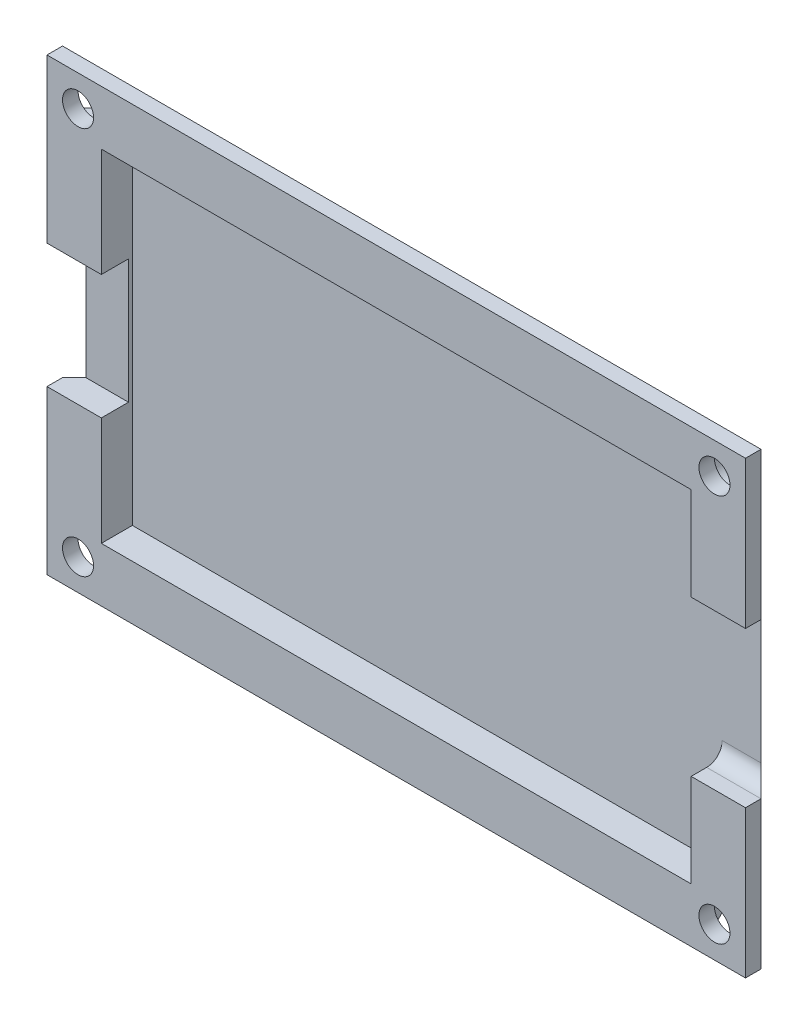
ISO-10303-21;
HEADER;
FILE_DESCRIPTION(('STEP AP214'),'2;1');
FILE_NAME('part.step','',(''),(''),'','','');
FILE_SCHEMA(('AUTOMOTIVE_DESIGN { 1 0 10303 214 1 1 1 1 }'));
ENDSEC;
DATA;
#1=APPLICATION_CONTEXT('core data for automotive mechanical design processes');
#2=APPLICATION_PROTOCOL_DEFINITION('international standard','automotive_design',2000,#1);
#3=PRODUCT_CONTEXT('',#1,'mechanical');
#4=PRODUCT('Part','Part','',(#3));
#5=PRODUCT_RELATED_PRODUCT_CATEGORY('part','',(#4));
#6=PRODUCT_DEFINITION_FORMATION('','',#4);
#7=PRODUCT_DEFINITION_CONTEXT('part definition',#1,'design');
#8=PRODUCT_DEFINITION('design','',#6,#7);
#9=PRODUCT_DEFINITION_SHAPE('','',#8);
#10=(LENGTH_UNIT() NAMED_UNIT(*) SI_UNIT(.MILLI.,.METRE.));
#11=(NAMED_UNIT(*) PLANE_ANGLE_UNIT() SI_UNIT($,.RADIAN.));
#12=(NAMED_UNIT(*) SI_UNIT($,.STERADIAN.) SOLID_ANGLE_UNIT());
#13=UNCERTAINTY_MEASURE_WITH_UNIT(LENGTH_MEASURE(1.E-05),#10,'distance_accuracy_value','');
#14=(GEOMETRIC_REPRESENTATION_CONTEXT(3) GLOBAL_UNCERTAINTY_ASSIGNED_CONTEXT((#13)) GLOBAL_UNIT_ASSIGNED_CONTEXT((#10,
#11,#12)) REPRESENTATION_CONTEXT('',''));
#15=CARTESIAN_POINT('',(0.,0.,0.));
#16=DIRECTION('',(0.,0.,1.));
#17=DIRECTION('',(1.,0.,0.));
#18=AXIS2_PLACEMENT_3D('',#15,#16,#17);
#19=CARTESIAN_POINT('',(-22.5,-14.5,3.));
#20=DIRECTION('',(1.,0.,0.));
#21=DIRECTION('',(0.,0.,-1.));
#22=AXIS2_PLACEMENT_3D('',#19,#20,#21);
#23=PLANE('',#22);
#24=DIRECTION('',(0.,1.,0.));
#25=VECTOR('',#24,1.);
#26=CARTESIAN_POINT('',(-22.5,14.5,2.));
#27=LINE('',#26,#25);
#28=CARTESIAN_POINT('',(-22.5,11.05,2.));
#29=VERTEX_POINT('',#28);
#30=CARTESIAN_POINT('',(-22.5,14.5,2.));
#31=VERTEX_POINT('',#30);
#32=EDGE_CURVE('E275',#29,#31,#27,.T.);
#33=ORIENTED_EDGE('',*,*,#32,.F.);
#34=DIRECTION('',(0.,-1.,0.));
#35=VECTOR('',#34,1.);
#36=CARTESIAN_POINT('',(-22.5,-11.05,2.00000000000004));
#37=LINE('',#36,#35);
#38=CARTESIAN_POINT('',(-22.5,4.,2.00000000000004));
#39=VERTEX_POINT('',#38);
#40=EDGE_CURVE('E411',#29,#39,#37,.T.);
#41=ORIENTED_EDGE('',*,*,#40,.T.);
#42=DIRECTION('',(0.,0.,-1.));
#43=VECTOR('',#42,1.);
#44=CARTESIAN_POINT('',(-22.5,4.,1.25));
#45=LINE('',#44,#43);
#46=CARTESIAN_POINT('',(-22.5,4.,3.));
#47=VERTEX_POINT('',#46);
#48=EDGE_CURVE('E581',#47,#39,#45,.T.);
#49=ORIENTED_EDGE('',*,*,#48,.F.);
#50=DIRECTION('',(0.,-1.,0.));
#51=VECTOR('',#50,1.);
#52=CARTESIAN_POINT('',(-22.5,-14.5,3.));
#53=LINE('',#52,#51);
#54=CARTESIAN_POINT('',(-22.5,14.5,3.));
#55=VERTEX_POINT('',#54);
#56=EDGE_CURVE('E306',#55,#47,#53,.T.);
#57=ORIENTED_EDGE('',*,*,#56,.F.);
#58=DIRECTION('',(0.,0.,-1.));
#59=VECTOR('',#58,1.);
#60=CARTESIAN_POINT('',(-22.5,14.5,3.));
#61=LINE('',#60,#59);
#62=EDGE_CURVE('E296',#55,#31,#61,.T.);
#63=ORIENTED_EDGE('',*,*,#62,.T.);
#64=EDGE_LOOP('',(#33,#41,#49,#57,#63));
#65=FACE_BOUND('',#64,.T.);
#66=ADVANCED_FACE('F47',(#65),#23,.F.);
#67=CARTESIAN_POINT('',(22.5,-14.5,3.));
#68=DIRECTION('',(-1.,0.,0.));
#69=DIRECTION('',(0.,0.,1.));
#70=AXIS2_PLACEMENT_3D('',#67,#68,#69);
#71=PLANE('',#70);
#72=DIRECTION('',(0.,-1.,0.));
#73=VECTOR('',#72,1.);
#74=CARTESIAN_POINT('',(22.5,-14.5,2.));
#75=LINE('',#74,#73);
#76=CARTESIAN_POINT('',(22.5,-11.05,2.));
#77=VERTEX_POINT('',#76);
#78=CARTESIAN_POINT('',(22.5,-14.5,2.));
#79=VERTEX_POINT('',#78);
#80=EDGE_CURVE('E532',#77,#79,#75,.T.);
#81=ORIENTED_EDGE('',*,*,#80,.F.);
#82=DIRECTION('',(0.,1.,0.));
#83=VECTOR('',#82,1.);
#84=CARTESIAN_POINT('',(22.5,11.05,2.00000000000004));
#85=LINE('',#84,#83);
#86=CARTESIAN_POINT('',(22.5,-5.,2.00000000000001));
#87=VERTEX_POINT('',#86);
#88=EDGE_CURVE('E361',#77,#87,#85,.T.);
#89=ORIENTED_EDGE('',*,*,#88,.T.);
#90=DIRECTION('',(0.,0.,-1.));
#91=VECTOR('',#90,1.);
#92=CARTESIAN_POINT('',(22.5,-5.,3.99999999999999));
#93=LINE('',#92,#91);
#94=CARTESIAN_POINT('',(22.5,-5.,3.));
#95=VERTEX_POINT('',#94);
#96=EDGE_CURVE('E604',#95,#87,#93,.T.);
#97=ORIENTED_EDGE('',*,*,#96,.F.);
#98=DIRECTION('',(0.,1.,0.));
#99=VECTOR('',#98,1.);
#100=CARTESIAN_POINT('',(22.5,-14.5,3.));
#101=LINE('',#100,#99);
#102=CARTESIAN_POINT('',(22.5,-14.5,3.));
#103=VERTEX_POINT('',#102);
#104=EDGE_CURVE('E693',#103,#95,#101,.T.);
#105=ORIENTED_EDGE('',*,*,#104,.F.);
#106=DIRECTION('',(0.,0.,-1.));
#107=VECTOR('',#106,1.);
#108=CARTESIAN_POINT('',(22.5,-14.5,3.));
#109=LINE('',#108,#107);
#110=EDGE_CURVE('E317',#103,#79,#109,.T.);
#111=ORIENTED_EDGE('',*,*,#110,.T.);
#112=EDGE_LOOP('',(#81,#89,#97,#105,#111));
#113=FACE_BOUND('',#112,.T.);
#114=ADVANCED_FACE('F711',(#113),#71,.F.);
#115=CARTESIAN_POINT('',(-20.5,12.5,-6.));
#116=DIRECTION('',(0.,0.,1.));
#117=DIRECTION('',(1.,0.,0.));
#118=AXIS2_PLACEMENT_3D('',#115,#116,#117);
#119=CYLINDRICAL_SURFACE('',#118,1.);
#120=CARTESIAN_POINT('',(-20.5,12.5,3.));
#121=DIRECTION('',(0.,0.,1.));
#122=DIRECTION('',(1.,0.,0.));
#123=AXIS2_PLACEMENT_3D('',#120,#121,#122);
#124=CIRCLE('',#123,1.);
#125=CARTESIAN_POINT('',(-19.5,12.5,3.));
#126=VERTEX_POINT('',#125);
#127=EDGE_CURVE('E570',#126,#126,#124,.T.);
#128=ORIENTED_EDGE('',*,*,#127,.T.);
#129=EDGE_LOOP('',(#128));
#130=FACE_BOUND('',#129,.T.);
#131=CARTESIAN_POINT('',(-20.5,12.5,2.));
#132=DIRECTION('',(0.,0.,-1.));
#133=DIRECTION('',(-1.,0.,0.));
#134=AXIS2_PLACEMENT_3D('',#131,#132,#133);
#135=CIRCLE('',#134,1.);
#136=CARTESIAN_POINT('',(-21.5,12.5,2.));
#137=VERTEX_POINT('',#136);
#138=EDGE_CURVE('E354',#137,#137,#135,.F.);
#139=ORIENTED_EDGE('',*,*,#138,.F.);
#140=EDGE_LOOP('',(#139));
#141=FACE_BOUND('',#140,.T.);
#142=ADVANCED_FACE('F780',(#130,#141),#119,.F.);
#143=CARTESIAN_POINT('',(20.5,12.5,-6.));
#144=DIRECTION('',(0.,0.,1.));
#145=DIRECTION('',(1.,0.,0.));
#146=AXIS2_PLACEMENT_3D('',#143,#144,#145);
#147=CYLINDRICAL_SURFACE('',#146,1.);
#148=CARTESIAN_POINT('',(20.5,12.5,3.));
#149=DIRECTION('',(0.,0.,1.));
#150=DIRECTION('',(-1.,0.,0.));
#151=AXIS2_PLACEMENT_3D('',#148,#149,#150);
#152=CIRCLE('',#151,1.);
#153=CARTESIAN_POINT('',(19.5,12.5,3.));
#154=VERTEX_POINT('',#153);
#155=EDGE_CURVE('E566',#154,#154,#152,.T.);
#156=ORIENTED_EDGE('',*,*,#155,.T.);
#157=EDGE_LOOP('',(#156));
#158=FACE_BOUND('',#157,.T.);
#159=CARTESIAN_POINT('',(20.5,12.5,2.));
#160=DIRECTION('',(0.,0.,-1.));
#161=DIRECTION('',(-1.,0.,0.));
#162=AXIS2_PLACEMENT_3D('',#159,#160,#161);
#163=CIRCLE('',#162,1.);
#164=CARTESIAN_POINT('',(19.5,12.5,2.));
#165=VERTEX_POINT('',#164);
#166=EDGE_CURVE('E350',#165,#165,#163,.F.);
#167=ORIENTED_EDGE('',*,*,#166,.F.);
#168=EDGE_LOOP('',(#167));
#169=FACE_BOUND('',#168,.T.);
#170=ADVANCED_FACE('F915',(#158,#169),#147,.F.);
#171=CARTESIAN_POINT('',(20.5,-12.5,-6.));
#172=DIRECTION('',(0.,0.,1.));
#173=DIRECTION('',(1.,0.,0.));
#174=AXIS2_PLACEMENT_3D('',#171,#172,#173);
#175=CYLINDRICAL_SURFACE('',#174,1.);
#176=CARTESIAN_POINT('',(20.5,-12.5,3.));
#177=DIRECTION('',(0.,0.,1.));
#178=DIRECTION('',(1.,0.,0.));
#179=AXIS2_PLACEMENT_3D('',#176,#177,#178);
#180=CIRCLE('',#179,1.);
#181=CARTESIAN_POINT('',(21.5,-12.5,3.));
#182=VERTEX_POINT('',#181);
#183=EDGE_CURVE('E571',#182,#182,#180,.T.);
#184=ORIENTED_EDGE('',*,*,#183,.T.);
#185=EDGE_LOOP('',(#184));
#186=FACE_BOUND('',#185,.T.);
#187=CARTESIAN_POINT('',(20.5,-12.5,2.));
#188=DIRECTION('',(0.,0.,-1.));
#189=DIRECTION('',(-1.,0.,0.));
#190=AXIS2_PLACEMENT_3D('',#187,#188,#189);
#191=CIRCLE('',#190,1.);
#192=CARTESIAN_POINT('',(19.5,-12.5,2.));
#193=VERTEX_POINT('',#192);
#194=EDGE_CURVE('E345',#193,#193,#191,.F.);
#195=ORIENTED_EDGE('',*,*,#194,.F.);
#196=EDGE_LOOP('',(#195));
#197=FACE_BOUND('',#196,.T.);
#198=ADVANCED_FACE('F945',(#186,#197),#175,.F.);
#199=CARTESIAN_POINT('',(-20.5,-12.5,-6.));
#200=DIRECTION('',(0.,0.,1.));
#201=DIRECTION('',(1.,0.,0.));
#202=AXIS2_PLACEMENT_3D('',#199,#200,#201);
#203=CYLINDRICAL_SURFACE('',#202,0.999999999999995);
#204=CARTESIAN_POINT('',(-20.5,-12.5,3.));
#205=DIRECTION('',(0.,0.,1.));
#206=DIRECTION('',(-1.,0.,0.));
#207=AXIS2_PLACEMENT_3D('',#204,#205,#206);
#208=CIRCLE('',#207,0.999999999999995);
#209=CARTESIAN_POINT('',(-21.5,-12.5,3.));
#210=VERTEX_POINT('',#209);
#211=EDGE_CURVE('E358',#210,#210,#208,.T.);
#212=ORIENTED_EDGE('',*,*,#211,.T.);
#213=EDGE_LOOP('',(#212));
#214=FACE_BOUND('',#213,.T.);
#215=CARTESIAN_POINT('',(-20.5,-12.5,2.));
#216=DIRECTION('',(0.,0.,-1.));
#217=DIRECTION('',(-1.,0.,0.));
#218=AXIS2_PLACEMENT_3D('',#215,#216,#217);
#219=CIRCLE('',#218,0.999999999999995);
#220=CARTESIAN_POINT('',(-21.5,-12.5,2.));
#221=VERTEX_POINT('',#220);
#222=EDGE_CURVE('E341',#221,#221,#219,.F.);
#223=ORIENTED_EDGE('',*,*,#222,.F.);
#224=EDGE_LOOP('',(#223));
#225=FACE_BOUND('',#224,.T.);
#226=ADVANCED_FACE('F890',(#214,#225),#203,.F.);
#227=CARTESIAN_POINT('',(0.,0.,3.));
#228=DIRECTION('',(0.,0.,-1.));
#229=DIRECTION('',(-1.,0.,0.));
#230=AXIS2_PLACEMENT_3D('',#227,#228,#229);
#231=PLANE('',#230);
#232=ORIENTED_EDGE('',*,*,#211,.F.);
#233=EDGE_LOOP('',(#232));
#234=FACE_BOUND('',#233,.T.);
#235=ORIENTED_EDGE('',*,*,#183,.F.);
#236=EDGE_LOOP('',(#235));
#237=FACE_BOUND('',#236,.T.);
#238=DIRECTION('',(0.,-1.,0.));
#239=VECTOR('',#238,1.);
#240=CARTESIAN_POINT('',(-19.,-11.,3.));
#241=LINE('',#240,#239);
#242=CARTESIAN_POINT('',(-19.,-4.,3.));
#243=VERTEX_POINT('',#242);
#244=CARTESIAN_POINT('',(-19.,-11.,3.));
#245=VERTEX_POINT('',#244);
#246=EDGE_CURVE('E670',#243,#245,#241,.T.);
#247=ORIENTED_EDGE('',*,*,#246,.F.);
#248=DIRECTION('',(-1.,0.,0.));
#249=VECTOR('',#248,1.);
#250=CARTESIAN_POINT('',(0.,-4.,3.));
#251=LINE('',#250,#249);
#252=CARTESIAN_POINT('',(-22.5,-4.,3.));
#253=VERTEX_POINT('',#252);
#254=EDGE_CURVE('E600',#243,#253,#251,.T.);
#255=ORIENTED_EDGE('',*,*,#254,.T.);
#256=CARTESIAN_POINT('',(-22.5,-14.5,3.));
#257=VERTEX_POINT('',#256);
#258=EDGE_CURVE('E700',#253,#257,#53,.T.);
#259=ORIENTED_EDGE('',*,*,#258,.T.);
#260=DIRECTION('',(1.,0.,0.));
#261=VECTOR('',#260,1.);
#262=CARTESIAN_POINT('',(-22.5,-14.5,3.));
#263=LINE('',#262,#261);
#264=EDGE_CURVE('E703',#257,#103,#263,.T.);
#265=ORIENTED_EDGE('',*,*,#264,.T.);
#266=ORIENTED_EDGE('',*,*,#104,.T.);
#267=DIRECTION('',(-1.,0.,0.));
#268=VECTOR('',#267,1.);
#269=CARTESIAN_POINT('',(0.,-5.,3.));
#270=LINE('',#269,#268);
#271=CARTESIAN_POINT('',(19.,-5.,3.));
#272=VERTEX_POINT('',#271);
#273=EDGE_CURVE('E635',#95,#272,#270,.T.);
#274=ORIENTED_EDGE('',*,*,#273,.T.);
#275=DIRECTION('',(0.,1.,0.));
#276=VECTOR('',#275,1.);
#277=CARTESIAN_POINT('',(19.,-11.,3.));
#278=LINE('',#277,#276);
#279=CARTESIAN_POINT('',(19.,-11.,3.));
#280=VERTEX_POINT('',#279);
#281=EDGE_CURVE('E662',#280,#272,#278,.T.);
#282=ORIENTED_EDGE('',*,*,#281,.F.);
#283=DIRECTION('',(1.,0.,0.));
#284=VECTOR('',#283,1.);
#285=CARTESIAN_POINT('',(-19.,-11.,3.));
#286=LINE('',#285,#284);
#287=EDGE_CURVE('E675',#245,#280,#286,.T.);
#288=ORIENTED_EDGE('',*,*,#287,.F.);
#289=EDGE_LOOP('',(#247,#255,#259,#265,#266,#274,#282,#288));
#290=FACE_BOUND('',#289,.T.);
#291=ADVANCED_FACE('F746',(#234,#237,#290),#231,.F.);
#292=CARTESIAN_POINT('',(19.,-11.,1.));
#293=DIRECTION('',(1.,0.,0.));
#294=DIRECTION('',(0.,0.,-1.));
#295=AXIS2_PLACEMENT_3D('',#292,#293,#294);
#296=PLANE('',#295);
#297=CARTESIAN_POINT('',(19.,4.,2.));
#298=DIRECTION('',(1.,0.,0.));
#299=DIRECTION('',(0.,0.,-1.));
#300=AXIS2_PLACEMENT_3D('',#297,#298,#299);
#301=CIRCLE('',#300,1.);
#302=CARTESIAN_POINT('',(19.,3.99999999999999,0.999999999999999));
#303=VERTEX_POINT('',#302);
#304=CARTESIAN_POINT('',(19.,5.,2.00000000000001));
#305=VERTEX_POINT('',#304);
#306=EDGE_CURVE('E631',#303,#305,#301,.T.);
#307=ORIENTED_EDGE('',*,*,#306,.T.);
#308=DIRECTION('',(0.,0.,1.));
#309=VECTOR('',#308,1.);
#310=CARTESIAN_POINT('',(19.,5.,1.));
#311=LINE('',#310,#309);
#312=CARTESIAN_POINT('',(19.,5.,3.));
#313=VERTEX_POINT('',#312);
#314=EDGE_CURVE('E324',#305,#313,#311,.T.);
#315=ORIENTED_EDGE('',*,*,#314,.T.);
#316=CARTESIAN_POINT('',(19.,11.,3.));
#317=VERTEX_POINT('',#316);
#318=EDGE_CURVE('E643',#313,#317,#278,.T.);
#319=ORIENTED_EDGE('',*,*,#318,.T.);
#320=DIRECTION('',(0.,0.,1.));
#321=VECTOR('',#320,1.);
#322=CARTESIAN_POINT('',(19.,11.,1.));
#323=LINE('',#322,#321);
#324=CARTESIAN_POINT('',(19.,11.,1.));
#325=VERTEX_POINT('',#324);
#326=EDGE_CURVE('E661',#325,#317,#323,.T.);
#327=ORIENTED_EDGE('',*,*,#326,.F.);
#328=DIRECTION('',(0.,1.,0.));
#329=VECTOR('',#328,1.);
#330=CARTESIAN_POINT('',(19.,-11.,1.));
#331=LINE('',#330,#329);
#332=EDGE_CURVE('E649',#303,#325,#331,.T.);
#333=ORIENTED_EDGE('',*,*,#332,.F.);
#334=EDGE_LOOP('',(#307,#315,#319,#327,#333));
#335=FACE_BOUND('',#334,.T.);
#336=ADVANCED_FACE('F794',(#335),#296,.F.);
#337=DIRECTION('',(0.,0.,1.));
#338=VECTOR('',#337,1.);
#339=CARTESIAN_POINT('',(22.5,5.,3.99999999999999));
#340=LINE('',#339,#338);
#341=CARTESIAN_POINT('',(22.5,5.,2.00000000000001));
#342=VERTEX_POINT('',#341);
#343=CARTESIAN_POINT('',(22.5,5.,3.));
#344=VERTEX_POINT('',#343);
#345=EDGE_CURVE('E608',#342,#344,#340,.T.);
#346=ORIENTED_EDGE('',*,*,#345,.F.);
#347=DIRECTION('',(0.,1.,0.));
#348=VECTOR('',#347,1.);
#349=CARTESIAN_POINT('',(22.5,11.05,2.00000000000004));
#350=LINE('',#349,#348);
#351=CARTESIAN_POINT('',(22.5,11.05,2.));
#352=VERTEX_POINT('',#351);
#353=EDGE_CURVE('E340',#342,#352,#350,.T.);
#354=ORIENTED_EDGE('',*,*,#353,.T.);
#355=DIRECTION('',(0.,-1.,0.));
#356=VECTOR('',#355,1.);
#357=CARTESIAN_POINT('',(22.5,14.5,2.));
#358=LINE('',#357,#356);
#359=CARTESIAN_POINT('',(22.5,14.5,2.));
#360=VERTEX_POINT('',#359);
#361=EDGE_CURVE('E545',#360,#352,#358,.T.);
#362=ORIENTED_EDGE('',*,*,#361,.F.);
#363=DIRECTION('',(0.,0.,-1.));
#364=VECTOR('',#363,1.);
#365=CARTESIAN_POINT('',(22.5,14.5,3.));
#366=LINE('',#365,#364);
#367=CARTESIAN_POINT('',(22.5,14.5,3.));
#368=VERTEX_POINT('',#367);
#369=EDGE_CURVE('E308',#368,#360,#366,.T.);
#370=ORIENTED_EDGE('',*,*,#369,.F.);
#371=EDGE_CURVE('E682',#344,#368,#101,.T.);
#372=ORIENTED_EDGE('',*,*,#371,.F.);
#373=EDGE_LOOP('',(#346,#354,#362,#370,#372));
#374=FACE_BOUND('',#373,.T.);
#375=ADVANCED_FACE('F782',(#374),#71,.F.);
#376=CARTESIAN_POINT('',(-22.5,14.5,3.));
#377=DIRECTION('',(0.,-1.,0.));
#378=DIRECTION('',(0.,0.,-1.));
#379=AXIS2_PLACEMENT_3D('',#376,#377,#378);
#380=PLANE('',#379);
#381=DIRECTION('',(1.,0.,0.));
#382=VECTOR('',#381,1.);
#383=CARTESIAN_POINT('',(22.5,14.5,2.));
#384=LINE('',#383,#382);
#385=CARTESIAN_POINT('',(19.05,14.5,2.));
#386=VERTEX_POINT('',#385);
#387=EDGE_CURVE('E346',#386,#360,#384,.T.);
#388=ORIENTED_EDGE('',*,*,#387,.F.);
#389=DIRECTION('',(-1.,0.,0.));
#390=VECTOR('',#389,1.);
#391=CARTESIAN_POINT('',(-19.05,14.5,2.));
#392=LINE('',#391,#390);
#393=CARTESIAN_POINT('',(-19.05,14.5,2.));
#394=VERTEX_POINT('',#393);
#395=EDGE_CURVE('E299',#386,#394,#392,.T.);
#396=ORIENTED_EDGE('',*,*,#395,.T.);
#397=DIRECTION('',(1.,0.,0.));
#398=VECTOR('',#397,1.);
#399=CARTESIAN_POINT('',(-22.5,14.5,2.));
#400=LINE('',#399,#398);
#401=EDGE_CURVE('E279',#31,#394,#400,.T.);
#402=ORIENTED_EDGE('',*,*,#401,.F.);
#403=ORIENTED_EDGE('',*,*,#62,.F.);
#404=DIRECTION('',(-1.,0.,0.));
#405=VECTOR('',#404,1.);
#406=CARTESIAN_POINT('',(-22.5,14.5,3.));
#407=LINE('',#406,#405);
#408=EDGE_CURVE('E697',#368,#55,#407,.T.);
#409=ORIENTED_EDGE('',*,*,#408,.F.);
#410=ORIENTED_EDGE('',*,*,#369,.T.);
#411=EDGE_LOOP('',(#388,#396,#402,#403,#409,#410));
#412=FACE_BOUND('',#411,.T.);
#413=ADVANCED_FACE('F294',(#412),#380,.F.);
#414=DIRECTION('',(0.,0.,1.));
#415=VECTOR('',#414,1.);
#416=CARTESIAN_POINT('',(-22.5,-4.,1.25));
#417=LINE('',#416,#415);
#418=CARTESIAN_POINT('',(-22.5,-4.,2.00000000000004));
#419=VERTEX_POINT('',#418);
#420=EDGE_CURVE('E585',#419,#253,#417,.T.);
#421=ORIENTED_EDGE('',*,*,#420,.F.);
#422=DIRECTION('',(0.,-1.,0.));
#423=VECTOR('',#422,1.);
#424=CARTESIAN_POINT('',(-22.5,-11.05,2.00000000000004));
#425=LINE('',#424,#423);
#426=CARTESIAN_POINT('',(-22.5,-11.05,2.));
#427=VERTEX_POINT('',#426);
#428=EDGE_CURVE('E408',#419,#427,#425,.T.);
#429=ORIENTED_EDGE('',*,*,#428,.T.);
#430=DIRECTION('',(0.,1.,0.));
#431=VECTOR('',#430,1.);
#432=CARTESIAN_POINT('',(-22.5,-14.5,2.));
#433=LINE('',#432,#431);
#434=CARTESIAN_POINT('',(-22.5,-14.5,2.));
#435=VERTEX_POINT('',#434);
#436=EDGE_CURVE('E518',#435,#427,#433,.T.);
#437=ORIENTED_EDGE('',*,*,#436,.F.);
#438=DIRECTION('',(0.,0.,-1.));
#439=VECTOR('',#438,1.);
#440=CARTESIAN_POINT('',(-22.5,-14.5,3.));
#441=LINE('',#440,#439);
#442=EDGE_CURVE('E309',#257,#435,#441,.T.);
#443=ORIENTED_EDGE('',*,*,#442,.F.);
#444=ORIENTED_EDGE('',*,*,#258,.F.);
#445=EDGE_LOOP('',(#421,#429,#437,#443,#444));
#446=FACE_BOUND('',#445,.T.);
#447=ADVANCED_FACE('F754',(#446),#23,.F.);
#448=CARTESIAN_POINT('',(-22.5,-14.5,3.));
#449=DIRECTION('',(0.,1.,0.));
#450=DIRECTION('',(0.,0.,1.));
#451=AXIS2_PLACEMENT_3D('',#448,#449,#450);
#452=PLANE('',#451);
#453=DIRECTION('',(-1.,0.,0.));
#454=VECTOR('',#453,1.);
#455=CARTESIAN_POINT('',(-22.5,-14.5,2.));
#456=LINE('',#455,#454);
#457=CARTESIAN_POINT('',(-19.05,-14.5,2.));
#458=VERTEX_POINT('',#457);
#459=EDGE_CURVE('E514',#458,#435,#456,.T.);
#460=ORIENTED_EDGE('',*,*,#459,.F.);
#461=DIRECTION('',(1.,0.,0.));
#462=VECTOR('',#461,1.);
#463=CARTESIAN_POINT('',(19.05,-14.5,2.));
#464=LINE('',#463,#462);
#465=CARTESIAN_POINT('',(19.05,-14.5,2.));
#466=VERTEX_POINT('',#465);
#467=EDGE_CURVE('E397',#458,#466,#464,.T.);
#468=ORIENTED_EDGE('',*,*,#467,.T.);
#469=DIRECTION('',(-1.,0.,0.));
#470=VECTOR('',#469,1.);
#471=CARTESIAN_POINT('',(22.5,-14.5,2.));
#472=LINE('',#471,#470);
#473=EDGE_CURVE('E528',#79,#466,#472,.T.);
#474=ORIENTED_EDGE('',*,*,#473,.F.);
#475=ORIENTED_EDGE('',*,*,#110,.F.);
#476=ORIENTED_EDGE('',*,*,#264,.F.);
#477=ORIENTED_EDGE('',*,*,#442,.T.);
#478=EDGE_LOOP('',(#460,#468,#474,#475,#476,#477));
#479=FACE_BOUND('',#478,.T.);
#480=ADVANCED_FACE('F717',(#479),#452,.F.);
#481=ORIENTED_EDGE('',*,*,#155,.F.);
#482=EDGE_LOOP('',(#481));
#483=FACE_BOUND('',#482,.T.);
#484=ORIENTED_EDGE('',*,*,#127,.F.);
#485=EDGE_LOOP('',(#484));
#486=FACE_BOUND('',#485,.T.);
#487=ORIENTED_EDGE('',*,*,#56,.T.);
#488=DIRECTION('',(1.,0.,0.));
#489=VECTOR('',#488,1.);
#490=CARTESIAN_POINT('',(0.,4.,3.));
#491=LINE('',#490,#489);
#492=CARTESIAN_POINT('',(-19.,4.,3.));
#493=VERTEX_POINT('',#492);
#494=EDGE_CURVE('E593',#47,#493,#491,.T.);
#495=ORIENTED_EDGE('',*,*,#494,.T.);
#496=CARTESIAN_POINT('',(-19.,11.,3.));
#497=VERTEX_POINT('',#496);
#498=EDGE_CURVE('E671',#497,#493,#241,.T.);
#499=ORIENTED_EDGE('',*,*,#498,.F.);
#500=DIRECTION('',(-1.,0.,0.));
#501=VECTOR('',#500,1.);
#502=CARTESIAN_POINT('',(-19.,11.,3.));
#503=LINE('',#502,#501);
#504=EDGE_CURVE('E666',#317,#497,#503,.T.);
#505=ORIENTED_EDGE('',*,*,#504,.F.);
#506=ORIENTED_EDGE('',*,*,#318,.F.);
#507=DIRECTION('',(1.,0.,0.));
#508=VECTOR('',#507,1.);
#509=CARTESIAN_POINT('',(0.,5.,3.));
#510=LINE('',#509,#508);
#511=EDGE_CURVE('E639',#313,#344,#510,.T.);
#512=ORIENTED_EDGE('',*,*,#511,.T.);
#513=ORIENTED_EDGE('',*,*,#371,.T.);
#514=ORIENTED_EDGE('',*,*,#408,.T.);
#515=EDGE_LOOP('',(#487,#495,#499,#505,#506,#512,#513,#514));
#516=FACE_BOUND('',#515,.T.);
#517=ADVANCED_FACE('F790',(#483,#486,#516),#231,.F.);
#518=CARTESIAN_POINT('',(0.,0.,0.));
#519=DIRECTION('',(0.,0.,-1.));
#520=DIRECTION('',(-1.,0.,0.));
#521=AXIS2_PLACEMENT_3D('',#518,#519,#520);
#522=PLANE('',#521);
#523=DIRECTION('',(-1.,0.,0.));
#524=VECTOR('',#523,1.);
#525=CARTESIAN_POINT('',(22.5,11.05,0.));
#526=LINE('',#525,#524);
#527=CARTESIAN_POINT('',(20.5,11.05,0.));
#528=VERTEX_POINT('',#527);
#529=CARTESIAN_POINT('',(20.05,11.05,0.));
#530=VERTEX_POINT('',#529);
#531=EDGE_CURVE('E559',#528,#530,#526,.T.);
#532=ORIENTED_EDGE('',*,*,#531,.F.);
#533=DIRECTION('',(0.,-1.,0.));
#534=VECTOR('',#533,1.);
#535=CARTESIAN_POINT('',(20.5,-11.05,0.));
#536=LINE('',#535,#534);
#537=CARTESIAN_POINT('',(20.5,-11.05,0.));
#538=VERTEX_POINT('',#537);
#539=EDGE_CURVE('E389',#528,#538,#536,.T.);
#540=ORIENTED_EDGE('',*,*,#539,.T.);
#541=DIRECTION('',(1.,0.,0.));
#542=VECTOR('',#541,1.);
#543=CARTESIAN_POINT('',(22.5,-11.05,0.));
#544=LINE('',#543,#542);
#545=CARTESIAN_POINT('',(20.05,-11.05,0.));
#546=VERTEX_POINT('',#545);
#547=EDGE_CURVE('E525',#546,#538,#544,.T.);
#548=ORIENTED_EDGE('',*,*,#547,.F.);
#549=CARTESIAN_POINT('',(20.05,-12.05,0.));
#550=DIRECTION('',(0.,0.,-1.));
#551=DIRECTION('',(-1.,0.,0.));
#552=AXIS2_PLACEMENT_3D('',#549,#550,#551);
#553=CIRCLE('',#552,1.);
#554=CARTESIAN_POINT('',(19.05,-12.05,0.));
#555=VERTEX_POINT('',#554);
#556=EDGE_CURVE('E480',#546,#555,#553,.F.);
#557=ORIENTED_EDGE('',*,*,#556,.T.);
#558=DIRECTION('',(0.,1.,0.));
#559=VECTOR('',#558,1.);
#560=CARTESIAN_POINT('',(19.05,-14.5,0.));
#561=LINE('',#560,#559);
#562=CARTESIAN_POINT('',(19.05,-12.5,0.));
#563=VERTEX_POINT('',#562);
#564=EDGE_CURVE('E520',#563,#555,#561,.T.);
#565=ORIENTED_EDGE('',*,*,#564,.F.);
#566=DIRECTION('',(-1.,0.,0.));
#567=VECTOR('',#566,1.);
#568=CARTESIAN_POINT('',(-19.05,-12.5,0.));
#569=LINE('',#568,#567);
#570=CARTESIAN_POINT('',(-19.05,-12.5,0.));
#571=VERTEX_POINT('',#570);
#572=EDGE_CURVE('E385',#563,#571,#569,.T.);
#573=ORIENTED_EDGE('',*,*,#572,.T.);
#574=DIRECTION('',(0.,-1.,0.));
#575=VECTOR('',#574,1.);
#576=CARTESIAN_POINT('',(-19.05,-14.5,0.));
#577=LINE('',#576,#575);
#578=CARTESIAN_POINT('',(-19.05,-12.05,0.));
#579=VERTEX_POINT('',#578);
#580=EDGE_CURVE('E489',#579,#571,#577,.T.);
#581=ORIENTED_EDGE('',*,*,#580,.F.);
#582=CARTESIAN_POINT('',(-20.05,-12.05,0.));
#583=DIRECTION('',(0.,0.,-1.));
#584=DIRECTION('',(-1.,0.,0.));
#585=AXIS2_PLACEMENT_3D('',#582,#583,#584);
#586=CIRCLE('',#585,1.);
#587=CARTESIAN_POINT('',(-20.05,-11.05,0.));
#588=VERTEX_POINT('',#587);
#589=EDGE_CURVE('E56',#579,#588,#586,.F.);
#590=ORIENTED_EDGE('',*,*,#589,.T.);
#591=DIRECTION('',(1.,0.,0.));
#592=VECTOR('',#591,1.);
#593=CARTESIAN_POINT('',(-22.5,-11.05,0.));
#594=LINE('',#593,#592);
#595=CARTESIAN_POINT('',(-20.5,-11.05,0.));
#596=VERTEX_POINT('',#595);
#597=EDGE_CURVE('E288',#596,#588,#594,.T.);
#598=ORIENTED_EDGE('',*,*,#597,.F.);
#599=DIRECTION('',(0.,1.,0.));
#600=VECTOR('',#599,1.);
#601=CARTESIAN_POINT('',(-20.5,11.05,0.));
#602=LINE('',#601,#600);
#603=CARTESIAN_POINT('',(-20.5,11.05,0.));
#604=VERTEX_POINT('',#603);
#605=EDGE_CURVE('E381',#596,#604,#602,.T.);
#606=ORIENTED_EDGE('',*,*,#605,.T.);
#607=DIRECTION('',(-1.,0.,0.));
#608=VECTOR('',#607,1.);
#609=CARTESIAN_POINT('',(-22.5,11.05,0.));
#610=LINE('',#609,#608);
#611=CARTESIAN_POINT('',(-20.05,11.05,0.));
#612=VERTEX_POINT('',#611);
#613=EDGE_CURVE('E301',#612,#604,#610,.T.);
#614=ORIENTED_EDGE('',*,*,#613,.F.);
#615=CARTESIAN_POINT('',(-20.05,12.05,0.));
#616=DIRECTION('',(0.,0.,-1.));
#617=DIRECTION('',(-1.,0.,0.));
#618=AXIS2_PLACEMENT_3D('',#615,#616,#617);
#619=CIRCLE('',#618,1.);
#620=CARTESIAN_POINT('',(-19.05,12.05,0.));
#621=VERTEX_POINT('',#620);
#622=EDGE_CURVE('E11',#612,#621,#619,.F.);
#623=ORIENTED_EDGE('',*,*,#622,.T.);
#624=DIRECTION('',(0.,-1.,0.));
#625=VECTOR('',#624,1.);
#626=CARTESIAN_POINT('',(-19.05,14.5,0.));
#627=LINE('',#626,#625);
#628=CARTESIAN_POINT('',(-19.05,12.5,0.));
#629=VERTEX_POINT('',#628);
#630=EDGE_CURVE('E563',#629,#621,#627,.T.);
#631=ORIENTED_EDGE('',*,*,#630,.F.);
#632=DIRECTION('',(1.,0.,0.));
#633=VECTOR('',#632,1.);
#634=CARTESIAN_POINT('',(19.05,12.5,0.));
#635=LINE('',#634,#633);
#636=CARTESIAN_POINT('',(19.05,12.5,0.));
#637=VERTEX_POINT('',#636);
#638=EDGE_CURVE('E377',#629,#637,#635,.T.);
#639=ORIENTED_EDGE('',*,*,#638,.T.);
#640=DIRECTION('',(0.,1.,0.));
#641=VECTOR('',#640,1.);
#642=CARTESIAN_POINT('',(19.05,14.5,0.));
#643=LINE('',#642,#641);
#644=CARTESIAN_POINT('',(19.05,12.05,0.));
#645=VERTEX_POINT('',#644);
#646=EDGE_CURVE('E550',#645,#637,#643,.T.);
#647=ORIENTED_EDGE('',*,*,#646,.F.);
#648=CARTESIAN_POINT('',(20.05,12.05,0.));
#649=DIRECTION('',(0.,0.,-1.));
#650=DIRECTION('',(-1.,0.,0.));
#651=AXIS2_PLACEMENT_3D('',#648,#649,#650);
#652=CIRCLE('',#651,1.);
#653=EDGE_CURVE('E477',#645,#530,#652,.F.);
#654=ORIENTED_EDGE('',*,*,#653,.T.);
#655=EDGE_LOOP('',(#532,#540,#548,#557,#565,#573,#581,#590,#598,#606,#614,#623,#631,#639,#647,#654));
#656=FACE_BOUND('',#655,.T.);
#657=ADVANCED_FACE('F487',(#656),#522,.T.);
#658=DIRECTION('',(0.,0.,-1.));
#659=VECTOR('',#658,1.);
#660=CARTESIAN_POINT('',(19.,-5.,1.));
#661=LINE('',#660,#659);
#662=CARTESIAN_POINT('',(19.,-5.,2.00000000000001));
#663=VERTEX_POINT('',#662);
#664=EDGE_CURVE('E314',#272,#663,#661,.T.);
#665=ORIENTED_EDGE('',*,*,#664,.T.);
#666=CARTESIAN_POINT('',(19.,-4.,2.));
#667=DIRECTION('',(1.,0.,0.));
#668=DIRECTION('',(0.,0.,-1.));
#669=AXIS2_PLACEMENT_3D('',#666,#667,#668);
#670=CIRCLE('',#669,1.);
#671=CARTESIAN_POINT('',(19.,-4.,0.999999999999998));
#672=VERTEX_POINT('',#671);
#673=EDGE_CURVE('E616',#663,#672,#670,.T.);
#674=ORIENTED_EDGE('',*,*,#673,.T.);
#675=CARTESIAN_POINT('',(19.,-11.,1.));
#676=VERTEX_POINT('',#675);
#677=EDGE_CURVE('E644',#676,#672,#331,.T.);
#678=ORIENTED_EDGE('',*,*,#677,.F.);
#679=DIRECTION('',(0.,0.,1.));
#680=VECTOR('',#679,1.);
#681=CARTESIAN_POINT('',(19.,-11.,1.));
#682=LINE('',#681,#680);
#683=EDGE_CURVE('E679',#676,#280,#682,.T.);
#684=ORIENTED_EDGE('',*,*,#683,.T.);
#685=ORIENTED_EDGE('',*,*,#281,.T.);
#686=EDGE_LOOP('',(#665,#674,#678,#684,#685));
#687=FACE_BOUND('',#686,.T.);
#688=ADVANCED_FACE('F742',(#687),#296,.F.);
#689=CARTESIAN_POINT('',(-19.,-11.,1.));
#690=DIRECTION('',(0.,-1.,0.));
#691=DIRECTION('',(0.,0.,-1.));
#692=AXIS2_PLACEMENT_3D('',#689,#690,#691);
#693=PLANE('',#692);
#694=ORIENTED_EDGE('',*,*,#287,.T.);
#695=ORIENTED_EDGE('',*,*,#683,.F.);
#696=DIRECTION('',(1.,0.,0.));
#697=VECTOR('',#696,1.);
#698=CARTESIAN_POINT('',(-19.,-11.,1.));
#699=LINE('',#698,#697);
#700=CARTESIAN_POINT('',(-19.,-11.,1.));
#701=VERTEX_POINT('',#700);
#702=EDGE_CURVE('E657',#701,#676,#699,.T.);
#703=ORIENTED_EDGE('',*,*,#702,.F.);
#704=DIRECTION('',(0.,0.,1.));
#705=VECTOR('',#704,1.);
#706=CARTESIAN_POINT('',(-19.,-11.,1.));
#707=LINE('',#706,#705);
#708=EDGE_CURVE('E683',#701,#245,#707,.T.);
#709=ORIENTED_EDGE('',*,*,#708,.T.);
#710=EDGE_LOOP('',(#694,#695,#703,#709));
#711=FACE_BOUND('',#710,.T.);
#712=ADVANCED_FACE('F894',(#711),#693,.F.);
#713=CARTESIAN_POINT('',(-19.,-11.,1.));
#714=DIRECTION('',(-1.,0.,0.));
#715=DIRECTION('',(0.,0.,1.));
#716=AXIS2_PLACEMENT_3D('',#713,#714,#715);
#717=PLANE('',#716);
#718=DIRECTION('',(0.,-1.,0.));
#719=VECTOR('',#718,1.);
#720=CARTESIAN_POINT('',(-19.,-11.,1.25));
#721=LINE('',#720,#719);
#722=CARTESIAN_POINT('',(-19.,4.,1.25));
#723=VERTEX_POINT('',#722);
#724=CARTESIAN_POINT('',(-19.,-4.,1.25));
#725=VERTEX_POINT('',#724);
#726=EDGE_CURVE('E332',#723,#725,#721,.T.);
#727=ORIENTED_EDGE('',*,*,#726,.T.);
#728=DIRECTION('',(0.,0.,1.));
#729=VECTOR('',#728,1.);
#730=CARTESIAN_POINT('',(-19.,-4.,1.));
#731=LINE('',#730,#729);
#732=EDGE_CURVE('E336',#725,#243,#731,.T.);
#733=ORIENTED_EDGE('',*,*,#732,.T.);
#734=ORIENTED_EDGE('',*,*,#246,.T.);
#735=ORIENTED_EDGE('',*,*,#708,.F.);
#736=DIRECTION('',(0.,-1.,0.));
#737=VECTOR('',#736,1.);
#738=CARTESIAN_POINT('',(-19.,-11.,1.));
#739=LINE('',#738,#737);
#740=CARTESIAN_POINT('',(-19.,11.,1.));
#741=VERTEX_POINT('',#740);
#742=EDGE_CURVE('E653',#741,#701,#739,.T.);
#743=ORIENTED_EDGE('',*,*,#742,.F.);
#744=DIRECTION('',(0.,0.,1.));
#745=VECTOR('',#744,1.);
#746=CARTESIAN_POINT('',(-19.,11.,1.));
#747=LINE('',#746,#745);
#748=EDGE_CURVE('E687',#741,#497,#747,.T.);
#749=ORIENTED_EDGE('',*,*,#748,.T.);
#750=ORIENTED_EDGE('',*,*,#498,.T.);
#751=DIRECTION('',(0.,0.,-1.));
#752=VECTOR('',#751,1.);
#753=CARTESIAN_POINT('',(-19.,4.,1.));
#754=LINE('',#753,#752);
#755=EDGE_CURVE('E328',#493,#723,#754,.T.);
#756=ORIENTED_EDGE('',*,*,#755,.T.);
#757=EDGE_LOOP('',(#727,#733,#734,#735,#743,#749,#750,#756));
#758=FACE_BOUND('',#757,.T.);
#759=ADVANCED_FACE('F867',(#758),#717,.F.);
#760=CARTESIAN_POINT('',(-19.,11.,1.));
#761=DIRECTION('',(0.,1.,0.));
#762=DIRECTION('',(0.,0.,1.));
#763=AXIS2_PLACEMENT_3D('',#760,#761,#762);
#764=PLANE('',#763);
#765=ORIENTED_EDGE('',*,*,#504,.T.);
#766=ORIENTED_EDGE('',*,*,#748,.F.);
#767=DIRECTION('',(-1.,0.,0.));
#768=VECTOR('',#767,1.);
#769=CARTESIAN_POINT('',(-19.,11.,1.));
#770=LINE('',#769,#768);
#771=EDGE_CURVE('E648',#325,#741,#770,.T.);
#772=ORIENTED_EDGE('',*,*,#771,.F.);
#773=ORIENTED_EDGE('',*,*,#326,.T.);
#774=EDGE_LOOP('',(#765,#766,#772,#773));
#775=FACE_BOUND('',#774,.T.);
#776=ADVANCED_FACE('F871',(#775),#764,.F.);
#777=CARTESIAN_POINT('',(0.,0.,1.));
#778=DIRECTION('',(0.,0.,-1.));
#779=DIRECTION('',(-1.,0.,0.));
#780=AXIS2_PLACEMENT_3D('',#777,#778,#779);
#781=PLANE('',#780);
#782=DIRECTION('',(1.,0.,0.));
#783=VECTOR('',#782,1.);
#784=CARTESIAN_POINT('',(13.5,-4.,0.999999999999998));
#785=LINE('',#784,#783);
#786=CARTESIAN_POINT('',(21.5,-4.,0.999999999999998));
#787=VERTEX_POINT('',#786);
#788=EDGE_CURVE('E621',#672,#787,#785,.T.);
#789=ORIENTED_EDGE('',*,*,#788,.T.);
#790=DIRECTION('',(0.,1.,0.));
#791=VECTOR('',#790,1.);
#792=CARTESIAN_POINT('',(21.5,-14.5,1.));
#793=LINE('',#792,#791);
#794=CARTESIAN_POINT('',(21.5,3.99999999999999,0.999999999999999));
#795=VERTEX_POINT('',#794);
#796=EDGE_CURVE('E368',#787,#795,#793,.T.);
#797=ORIENTED_EDGE('',*,*,#796,.T.);
#798=DIRECTION('',(1.,0.,0.));
#799=VECTOR('',#798,1.);
#800=CARTESIAN_POINT('',(13.5,3.99999999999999,0.999999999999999));
#801=LINE('',#800,#799);
#802=EDGE_CURVE('E617',#303,#795,#801,.T.);
#803=ORIENTED_EDGE('',*,*,#802,.F.);
#804=ORIENTED_EDGE('',*,*,#332,.T.);
#805=ORIENTED_EDGE('',*,*,#771,.T.);
#806=ORIENTED_EDGE('',*,*,#742,.T.);
#807=ORIENTED_EDGE('',*,*,#702,.T.);
#808=ORIENTED_EDGE('',*,*,#677,.T.);
#809=EDGE_LOOP('',(#789,#797,#803,#804,#805,#806,#807,#808));
#810=FACE_BOUND('',#809,.T.);
#811=ADVANCED_FACE('F882',(#810),#781,.F.);
#812=CARTESIAN_POINT('',(13.5,5.,3.99999999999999));
#813=DIRECTION('',(0.,1.,0.));
#814=DIRECTION('',(0.,0.,1.));
#815=AXIS2_PLACEMENT_3D('',#812,#813,#814);
#816=PLANE('',#815);
#817=ORIENTED_EDGE('',*,*,#314,.F.);
#818=DIRECTION('',(1.,0.,0.));
#819=VECTOR('',#818,1.);
#820=CARTESIAN_POINT('',(13.5,5.,2.00000000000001));
#821=LINE('',#820,#819);
#822=EDGE_CURVE('E612',#305,#342,#821,.T.);
#823=ORIENTED_EDGE('',*,*,#822,.T.);
#824=ORIENTED_EDGE('',*,*,#345,.T.);
#825=ORIENTED_EDGE('',*,*,#511,.F.);
#826=EDGE_LOOP('',(#817,#823,#824,#825));
#827=FACE_BOUND('',#826,.T.);
#828=ADVANCED_FACE('F962',(#827),#816,.F.);
#829=CARTESIAN_POINT('',(13.5,-5.,3.99999999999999));
#830=DIRECTION('',(0.,-1.,0.));
#831=DIRECTION('',(0.,0.,-1.));
#832=AXIS2_PLACEMENT_3D('',#829,#830,#831);
#833=PLANE('',#832);
#834=ORIENTED_EDGE('',*,*,#96,.T.);
#835=DIRECTION('',(1.,0.,0.));
#836=VECTOR('',#835,1.);
#837=CARTESIAN_POINT('',(13.5,-5.,2.00000000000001));
#838=LINE('',#837,#836);
#839=EDGE_CURVE('E611',#663,#87,#838,.T.);
#840=ORIENTED_EDGE('',*,*,#839,.F.);
#841=ORIENTED_EDGE('',*,*,#664,.F.);
#842=ORIENTED_EDGE('',*,*,#273,.F.);
#843=EDGE_LOOP('',(#834,#840,#841,#842));
#844=FACE_BOUND('',#843,.T.);
#845=ADVANCED_FACE('F736',(#844),#833,.F.);
#846=CARTESIAN_POINT('',(13.5,4.,2.));
#847=DIRECTION('',(1.,0.,0.));
#848=DIRECTION('',(0.,0.,-1.));
#849=AXIS2_PLACEMENT_3D('',#846,#847,#848);
#850=CYLINDRICAL_SURFACE('',#849,1.);
#851=ORIENTED_EDGE('',*,*,#802,.T.);
#852=CARTESIAN_POINT('',(22.5,4.,2.));
#853=DIRECTION('',(0.707106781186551,0.,-0.707106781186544));
#854=DIRECTION('',(0.707106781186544,0.,0.707106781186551));
#855=AXIS2_PLACEMENT_3D('',#852,#853,#854);
#856=ELLIPSE('',#855,1.41421356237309,1.);
#857=EDGE_CURVE('E371',#795,#342,#856,.T.);
#858=ORIENTED_EDGE('',*,*,#857,.T.);
#859=ORIENTED_EDGE('',*,*,#822,.F.);
#860=ORIENTED_EDGE('',*,*,#306,.F.);
#861=EDGE_LOOP('',(#851,#858,#859,#860));
#862=FACE_BOUND('',#861,.T.);
#863=ADVANCED_FACE('F966',(#862),#850,.F.);
#864=CARTESIAN_POINT('',(13.5,-4.,2.));
#865=DIRECTION('',(1.,0.,0.));
#866=DIRECTION('',(0.,0.,-1.));
#867=AXIS2_PLACEMENT_3D('',#864,#865,#866);
#868=CYLINDRICAL_SURFACE('',#867,1.);
#869=ORIENTED_EDGE('',*,*,#839,.T.);
#870=CARTESIAN_POINT('',(22.5,-4.,2.));
#871=DIRECTION('',(0.707106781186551,0.,-0.707106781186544));
#872=DIRECTION('',(0.707106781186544,0.,0.707106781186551));
#873=AXIS2_PLACEMENT_3D('',#870,#871,#872);
#874=ELLIPSE('',#873,1.41421356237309,1.);
#875=EDGE_CURVE('E365',#87,#787,#874,.T.);
#876=ORIENTED_EDGE('',*,*,#875,.T.);
#877=ORIENTED_EDGE('',*,*,#788,.F.);
#878=ORIENTED_EDGE('',*,*,#673,.F.);
#879=EDGE_LOOP('',(#869,#876,#877,#878));
#880=FACE_BOUND('',#879,.T.);
#881=ADVANCED_FACE('F739',(#880),#868,.F.);
#882=CARTESIAN_POINT('',(-13.5,-4.,1.25));
#883=DIRECTION('',(0.,-1.,0.));
#884=DIRECTION('',(0.,0.,-1.));
#885=AXIS2_PLACEMENT_3D('',#882,#883,#884);
#886=PLANE('',#885);
#887=DIRECTION('',(-1.,0.,0.));
#888=VECTOR('',#887,1.);
#889=CARTESIAN_POINT('',(-13.5,-4.,1.25));
#890=LINE('',#889,#888);
#891=CARTESIAN_POINT('',(-21.75,-4.,1.25));
#892=VERTEX_POINT('',#891);
#893=EDGE_CURVE('E589',#725,#892,#890,.T.);
#894=ORIENTED_EDGE('',*,*,#893,.T.);
#895=DIRECTION('',(-0.707106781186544,0.,0.707106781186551));
#896=VECTOR('',#895,1.);
#897=CARTESIAN_POINT('',(-22.5,-4.,2.00000000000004));
#898=LINE('',#897,#896);
#899=EDGE_CURVE('E420',#892,#419,#898,.T.);
#900=ORIENTED_EDGE('',*,*,#899,.T.);
#901=ORIENTED_EDGE('',*,*,#420,.T.);
#902=ORIENTED_EDGE('',*,*,#254,.F.);
#903=ORIENTED_EDGE('',*,*,#732,.F.);
#904=EDGE_LOOP('',(#894,#900,#901,#902,#903));
#905=FACE_BOUND('',#904,.T.);
#906=ADVANCED_FACE('F952',(#905),#886,.F.);
#907=CARTESIAN_POINT('',(-13.5,4.,1.25));
#908=DIRECTION('',(0.,0.,-1.));
#909=DIRECTION('',(0.,1.,0.));
#910=AXIS2_PLACEMENT_3D('',#907,#908,#909);
#911=PLANE('',#910);
#912=DIRECTION('',(-1.,0.,0.));
#913=VECTOR('',#912,1.);
#914=CARTESIAN_POINT('',(-13.5,4.,1.25));
#915=LINE('',#914,#913);
#916=CARTESIAN_POINT('',(-21.75,4.,1.25));
#917=VERTEX_POINT('',#916);
#918=EDGE_CURVE('E588',#723,#917,#915,.T.);
#919=ORIENTED_EDGE('',*,*,#918,.T.);
#920=DIRECTION('',(0.,-1.,0.));
#921=VECTOR('',#920,1.);
#922=CARTESIAN_POINT('',(-21.75,-14.5,1.25));
#923=LINE('',#922,#921);
#924=EDGE_CURVE('E417',#917,#892,#923,.T.);
#925=ORIENTED_EDGE('',*,*,#924,.T.);
#926=ORIENTED_EDGE('',*,*,#893,.F.);
#927=ORIENTED_EDGE('',*,*,#726,.F.);
#928=EDGE_LOOP('',(#919,#925,#926,#927));
#929=FACE_BOUND('',#928,.T.);
#930=ADVANCED_FACE('F955',(#929),#911,.F.);
#931=CARTESIAN_POINT('',(-13.5,4.,1.25));
#932=DIRECTION('',(0.,1.,0.));
#933=DIRECTION('',(0.,0.,1.));
#934=AXIS2_PLACEMENT_3D('',#931,#932,#933);
#935=PLANE('',#934);
#936=ORIENTED_EDGE('',*,*,#48,.T.);
#937=DIRECTION('',(0.707106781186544,0.,-0.707106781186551));
#938=VECTOR('',#937,1.);
#939=CARTESIAN_POINT('',(-22.5,4.,2.00000000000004));
#940=LINE('',#939,#938);
#941=EDGE_CURVE('E414',#39,#917,#940,.T.);
#942=ORIENTED_EDGE('',*,*,#941,.T.);
#943=ORIENTED_EDGE('',*,*,#918,.F.);
#944=ORIENTED_EDGE('',*,*,#755,.F.);
#945=ORIENTED_EDGE('',*,*,#494,.F.);
#946=EDGE_LOOP('',(#936,#942,#943,#944,#945));
#947=FACE_BOUND('',#946,.T.);
#948=ADVANCED_FACE('F862',(#947),#935,.F.);
#949=CARTESIAN_POINT('',(0.,0.,2.));
#950=DIRECTION('',(0.,0.,-1.));
#951=DIRECTION('',(-1.,0.,0.));
#952=AXIS2_PLACEMENT_3D('',#949,#950,#951);
#953=PLANE('',#952);
#954=DIRECTION('',(1.,0.,0.));
#955=VECTOR('',#954,1.);
#956=CARTESIAN_POINT('',(-22.5,-11.05,2.));
#957=LINE('',#956,#955);
#958=CARTESIAN_POINT('',(-20.05,-11.05,2.));
#959=VERTEX_POINT('',#958);
#960=EDGE_CURVE('E508',#427,#959,#957,.T.);
#961=ORIENTED_EDGE('',*,*,#960,.T.);
#962=CARTESIAN_POINT('',(-20.05,-12.05,2.));
#963=DIRECTION('',(0.,0.,-1.));
#964=DIRECTION('',(-1.,0.,0.));
#965=AXIS2_PLACEMENT_3D('',#962,#963,#964);
#966=CIRCLE('',#965,1.);
#967=CARTESIAN_POINT('',(-19.05,-12.05,2.));
#968=VERTEX_POINT('',#967);
#969=EDGE_CURVE('E465',#959,#968,#966,.T.);
#970=ORIENTED_EDGE('',*,*,#969,.T.);
#971=DIRECTION('',(0.,-1.,0.));
#972=VECTOR('',#971,1.);
#973=CARTESIAN_POINT('',(-19.05,-14.5,2.));
#974=LINE('',#973,#972);
#975=EDGE_CURVE('E506',#968,#458,#974,.T.);
#976=ORIENTED_EDGE('',*,*,#975,.T.);
#977=ORIENTED_EDGE('',*,*,#459,.T.);
#978=ORIENTED_EDGE('',*,*,#436,.T.);
#979=EDGE_LOOP('',(#961,#970,#976,#977,#978));
#980=FACE_BOUND('',#979,.T.);
#981=ORIENTED_EDGE('',*,*,#222,.T.);
#982=EDGE_LOOP('',(#981));
#983=FACE_BOUND('',#982,.T.);
#984=ADVANCED_FACE('F504',(#980,#983),#953,.T.);
#985=CARTESIAN_POINT('',(-19.05,-14.5,2.));
#986=DIRECTION('',(1.,0.,0.));
#987=DIRECTION('',(0.,0.,-1.));
#988=AXIS2_PLACEMENT_3D('',#985,#986,#987);
#989=PLANE('',#988);
#990=ORIENTED_EDGE('',*,*,#975,.F.);
#991=DIRECTION('',(0.,0.,-1.));
#992=VECTOR('',#991,1.);
#993=CARTESIAN_POINT('',(-19.05,-12.05,0.));
#994=LINE('',#993,#992);
#995=EDGE_CURVE('E458',#968,#579,#994,.T.);
#996=ORIENTED_EDGE('',*,*,#995,.T.);
#997=ORIENTED_EDGE('',*,*,#580,.T.);
#998=DIRECTION('',(0.,-0.707106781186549,0.707106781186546));
#999=VECTOR('',#998,1.);
#1000=CARTESIAN_POINT('',(-19.05,-14.5,2.));
#1001=LINE('',#1000,#999);
#1002=EDGE_CURVE('E404',#571,#458,#1001,.T.);
#1003=ORIENTED_EDGE('',*,*,#1002,.T.);
#1004=EDGE_LOOP('',(#990,#996,#997,#1003));
#1005=FACE_BOUND('',#1004,.T.);
#1006=ADVANCED_FACE('F510',(#1005),#989,.F.);
#1007=CARTESIAN_POINT('',(-22.5,-11.05,2.));
#1008=DIRECTION('',(0.,1.,0.));
#1009=DIRECTION('',(0.,0.,1.));
#1010=AXIS2_PLACEMENT_3D('',#1007,#1008,#1009);
#1011=PLANE('',#1010);
#1012=ORIENTED_EDGE('',*,*,#597,.T.);
#1013=DIRECTION('',(0.,0.,-1.));
#1014=VECTOR('',#1013,1.);
#1015=CARTESIAN_POINT('',(-20.05,-11.05,2.));
#1016=LINE('',#1015,#1014);
#1017=EDGE_CURVE('E462',#588,#959,#1016,.F.);
#1018=ORIENTED_EDGE('',*,*,#1017,.T.);
#1019=ORIENTED_EDGE('',*,*,#960,.F.);
#1020=DIRECTION('',(0.707106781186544,0.,-0.707106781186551));
#1021=VECTOR('',#1020,1.);
#1022=CARTESIAN_POINT('',(-22.5,-11.05,2.00000000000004));
#1023=LINE('',#1022,#1021);
#1024=EDGE_CURVE('E423',#427,#596,#1023,.T.);
#1025=ORIENTED_EDGE('',*,*,#1024,.T.);
#1026=EDGE_LOOP('',(#1012,#1018,#1019,#1025));
#1027=FACE_BOUND('',#1026,.T.);
#1028=ADVANCED_FACE('F494',(#1027),#1011,.F.);
#1029=CARTESIAN_POINT('',(0.,0.,2.));
#1030=DIRECTION('',(0.,0.,-1.));
#1031=DIRECTION('',(-1.,0.,0.));
#1032=AXIS2_PLACEMENT_3D('',#1029,#1030,#1031);
#1033=PLANE('',#1032);
#1034=DIRECTION('',(0.,1.,0.));
#1035=VECTOR('',#1034,1.);
#1036=CARTESIAN_POINT('',(19.05,-14.5,2.));
#1037=LINE('',#1036,#1035);
#1038=CARTESIAN_POINT('',(19.05,-12.05,2.));
#1039=VERTEX_POINT('',#1038);
#1040=EDGE_CURVE('E538',#466,#1039,#1037,.T.);
#1041=ORIENTED_EDGE('',*,*,#1040,.T.);
#1042=CARTESIAN_POINT('',(20.05,-12.05,2.));
#1043=DIRECTION('',(0.,0.,-1.));
#1044=DIRECTION('',(-1.,0.,0.));
#1045=AXIS2_PLACEMENT_3D('',#1042,#1043,#1044);
#1046=CIRCLE('',#1045,1.);
#1047=CARTESIAN_POINT('',(20.05,-11.05,2.));
#1048=VERTEX_POINT('',#1047);
#1049=EDGE_CURVE('E455',#1039,#1048,#1046,.T.);
#1050=ORIENTED_EDGE('',*,*,#1049,.T.);
#1051=DIRECTION('',(1.,0.,0.));
#1052=VECTOR('',#1051,1.);
#1053=CARTESIAN_POINT('',(22.5,-11.05,2.));
#1054=LINE('',#1053,#1052);
#1055=EDGE_CURVE('E535',#1048,#77,#1054,.T.);
#1056=ORIENTED_EDGE('',*,*,#1055,.T.);
#1057=ORIENTED_EDGE('',*,*,#80,.T.);
#1058=ORIENTED_EDGE('',*,*,#473,.T.);
#1059=EDGE_LOOP('',(#1041,#1050,#1056,#1057,#1058));
#1060=FACE_BOUND('',#1059,.T.);
#1061=ORIENTED_EDGE('',*,*,#194,.T.);
#1062=EDGE_LOOP('',(#1061));
#1063=FACE_BOUND('',#1062,.T.);
#1064=ADVANCED_FACE('F721',(#1060,#1063),#1033,.T.);
#1065=CARTESIAN_POINT('',(22.5,-11.05,2.));
#1066=DIRECTION('',(0.,1.,0.));
#1067=DIRECTION('',(0.,0.,1.));
#1068=AXIS2_PLACEMENT_3D('',#1065,#1066,#1067);
#1069=PLANE('',#1068);
#1070=ORIENTED_EDGE('',*,*,#1055,.F.);
#1071=DIRECTION('',(0.,0.,-1.));
#1072=VECTOR('',#1071,1.);
#1073=CARTESIAN_POINT('',(20.05,-11.05,0.));
#1074=LINE('',#1073,#1072);
#1075=EDGE_CURVE('E448',#1048,#546,#1074,.T.);
#1076=ORIENTED_EDGE('',*,*,#1075,.T.);
#1077=ORIENTED_EDGE('',*,*,#547,.T.);
#1078=DIRECTION('',(0.707106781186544,0.,0.707106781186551));
#1079=VECTOR('',#1078,1.);
#1080=CARTESIAN_POINT('',(22.5,-11.05,2.00000000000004));
#1081=LINE('',#1080,#1079);
#1082=EDGE_CURVE('E393',#538,#77,#1081,.T.);
#1083=ORIENTED_EDGE('',*,*,#1082,.T.);
#1084=EDGE_LOOP('',(#1070,#1076,#1077,#1083));
#1085=FACE_BOUND('',#1084,.T.);
#1086=ADVANCED_FACE('F728',(#1085),#1069,.F.);
#1087=CARTESIAN_POINT('',(19.05,-14.5,2.));
#1088=DIRECTION('',(-1.,0.,0.));
#1089=DIRECTION('',(0.,0.,1.));
#1090=AXIS2_PLACEMENT_3D('',#1087,#1088,#1089);
#1091=PLANE('',#1090);
#1092=ORIENTED_EDGE('',*,*,#564,.T.);
#1093=DIRECTION('',(0.,0.,-1.));
#1094=VECTOR('',#1093,1.);
#1095=CARTESIAN_POINT('',(19.05,-12.05,2.));
#1096=LINE('',#1095,#1094);
#1097=EDGE_CURVE('E452',#555,#1039,#1096,.F.);
#1098=ORIENTED_EDGE('',*,*,#1097,.T.);
#1099=ORIENTED_EDGE('',*,*,#1040,.F.);
#1100=DIRECTION('',(0.,0.707106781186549,-0.707106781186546));
#1101=VECTOR('',#1100,1.);
#1102=CARTESIAN_POINT('',(19.05,-14.5,2.));
#1103=LINE('',#1102,#1101);
#1104=EDGE_CURVE('E401',#466,#563,#1103,.T.);
#1105=ORIENTED_EDGE('',*,*,#1104,.T.);
#1106=EDGE_LOOP('',(#1092,#1098,#1099,#1105));
#1107=FACE_BOUND('',#1106,.T.);
#1108=ADVANCED_FACE('F760',(#1107),#1091,.F.);
#1109=CARTESIAN_POINT('',(0.,0.,2.));
#1110=DIRECTION('',(0.,0.,-1.));
#1111=DIRECTION('',(-1.,0.,0.));
#1112=AXIS2_PLACEMENT_3D('',#1109,#1110,#1111);
#1113=PLANE('',#1112);
#1114=DIRECTION('',(-1.,0.,0.));
#1115=VECTOR('',#1114,1.);
#1116=CARTESIAN_POINT('',(22.5,11.05,2.));
#1117=LINE('',#1116,#1115);
#1118=CARTESIAN_POINT('',(20.05,11.05,2.));
#1119=VERTEX_POINT('',#1118);
#1120=EDGE_CURVE('E549',#352,#1119,#1117,.T.);
#1121=ORIENTED_EDGE('',*,*,#1120,.T.);
#1122=CARTESIAN_POINT('',(20.05,12.05,2.));
#1123=DIRECTION('',(0.,0.,-1.));
#1124=DIRECTION('',(-1.,0.,0.));
#1125=AXIS2_PLACEMENT_3D('',#1122,#1123,#1124);
#1126=CIRCLE('',#1125,1.);
#1127=CARTESIAN_POINT('',(19.05,12.05,2.));
#1128=VERTEX_POINT('',#1127);
#1129=EDGE_CURVE('E445',#1119,#1128,#1126,.T.);
#1130=ORIENTED_EDGE('',*,*,#1129,.T.);
#1131=DIRECTION('',(0.,1.,0.));
#1132=VECTOR('',#1131,1.);
#1133=CARTESIAN_POINT('',(19.05,14.5,2.));
#1134=LINE('',#1133,#1132);
#1135=EDGE_CURVE('E554',#1128,#386,#1134,.T.);
#1136=ORIENTED_EDGE('',*,*,#1135,.T.);
#1137=ORIENTED_EDGE('',*,*,#387,.T.);
#1138=ORIENTED_EDGE('',*,*,#361,.T.);
#1139=EDGE_LOOP('',(#1121,#1130,#1136,#1137,#1138));
#1140=FACE_BOUND('',#1139,.T.);
#1141=ORIENTED_EDGE('',*,*,#166,.T.);
#1142=EDGE_LOOP('',(#1141));
#1143=FACE_BOUND('',#1142,.T.);
#1144=ADVANCED_FACE('F833',(#1140,#1143),#1113,.T.);
#1145=CARTESIAN_POINT('',(19.05,14.5,2.));
#1146=DIRECTION('',(-1.,0.,0.));
#1147=DIRECTION('',(0.,0.,1.));
#1148=AXIS2_PLACEMENT_3D('',#1145,#1146,#1147);
#1149=PLANE('',#1148);
#1150=ORIENTED_EDGE('',*,*,#1135,.F.);
#1151=DIRECTION('',(0.,0.,-1.));
#1152=VECTOR('',#1151,1.);
#1153=CARTESIAN_POINT('',(19.05,12.05,0.));
#1154=LINE('',#1153,#1152);
#1155=EDGE_CURVE('E438',#1128,#645,#1154,.T.);
#1156=ORIENTED_EDGE('',*,*,#1155,.T.);
#1157=ORIENTED_EDGE('',*,*,#646,.T.);
#1158=DIRECTION('',(0.,0.707106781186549,0.707106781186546));
#1159=VECTOR('',#1158,1.);
#1160=CARTESIAN_POINT('',(19.05,14.5,2.));
#1161=LINE('',#1160,#1159);
#1162=EDGE_CURVE('E434',#637,#386,#1161,.T.);
#1163=ORIENTED_EDGE('',*,*,#1162,.T.);
#1164=EDGE_LOOP('',(#1150,#1156,#1157,#1163));
#1165=FACE_BOUND('',#1164,.T.);
#1166=ADVANCED_FACE('F827',(#1165),#1149,.F.);
#1167=CARTESIAN_POINT('',(22.5,11.05,2.));
#1168=DIRECTION('',(0.,-1.,0.));
#1169=DIRECTION('',(0.,0.,-1.));
#1170=AXIS2_PLACEMENT_3D('',#1167,#1168,#1169);
#1171=PLANE('',#1170);
#1172=ORIENTED_EDGE('',*,*,#531,.T.);
#1173=DIRECTION('',(0.,0.,-1.));
#1174=VECTOR('',#1173,1.);
#1175=CARTESIAN_POINT('',(20.05,11.05,2.));
#1176=LINE('',#1175,#1174);
#1177=EDGE_CURVE('E442',#530,#1119,#1176,.F.);
#1178=ORIENTED_EDGE('',*,*,#1177,.T.);
#1179=ORIENTED_EDGE('',*,*,#1120,.F.);
#1180=DIRECTION('',(-0.707106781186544,0.,-0.707106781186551));
#1181=VECTOR('',#1180,1.);
#1182=CARTESIAN_POINT('',(22.5,11.05,2.00000000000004));
#1183=LINE('',#1182,#1181);
#1184=EDGE_CURVE('E374',#352,#528,#1183,.T.);
#1185=ORIENTED_EDGE('',*,*,#1184,.T.);
#1186=EDGE_LOOP('',(#1172,#1178,#1179,#1185));
#1187=FACE_BOUND('',#1186,.T.);
#1188=ADVANCED_FACE('F841',(#1187),#1171,.F.);
#1189=CARTESIAN_POINT('',(0.,0.,2.));
#1190=DIRECTION('',(0.,0.,-1.));
#1191=DIRECTION('',(-1.,0.,0.));
#1192=AXIS2_PLACEMENT_3D('',#1189,#1190,#1191);
#1193=PLANE('',#1192);
#1194=DIRECTION('',(0.,-1.,0.));
#1195=VECTOR('',#1194,1.);
#1196=CARTESIAN_POINT('',(-19.05,14.5,2.));
#1197=LINE('',#1196,#1195);
#1198=CARTESIAN_POINT('',(-19.05,12.05,2.));
#1199=VERTEX_POINT('',#1198);
#1200=EDGE_CURVE('E302',#394,#1199,#1197,.T.);
#1201=ORIENTED_EDGE('',*,*,#1200,.T.);
#1202=CARTESIAN_POINT('',(-20.05,12.05,2.));
#1203=DIRECTION('',(0.,0.,-1.));
#1204=DIRECTION('',(-1.,0.,0.));
#1205=AXIS2_PLACEMENT_3D('',#1202,#1203,#1204);
#1206=CIRCLE('',#1205,1.);
#1207=CARTESIAN_POINT('',(-20.05,11.05,2.));
#1208=VERTEX_POINT('',#1207);
#1209=EDGE_CURVE('E474',#1199,#1208,#1206,.T.);
#1210=ORIENTED_EDGE('',*,*,#1209,.T.);
#1211=DIRECTION('',(-1.,0.,0.));
#1212=VECTOR('',#1211,1.);
#1213=CARTESIAN_POINT('',(-22.5,11.05,2.));
#1214=LINE('',#1213,#1212);
#1215=EDGE_CURVE('E281',#1208,#29,#1214,.T.);
#1216=ORIENTED_EDGE('',*,*,#1215,.T.);
#1217=ORIENTED_EDGE('',*,*,#32,.T.);
#1218=ORIENTED_EDGE('',*,*,#401,.T.);
#1219=EDGE_LOOP('',(#1201,#1210,#1216,#1217,#1218));
#1220=FACE_BOUND('',#1219,.T.);
#1221=ORIENTED_EDGE('',*,*,#138,.T.);
#1222=EDGE_LOOP('',(#1221));
#1223=FACE_BOUND('',#1222,.T.);
#1224=ADVANCED_FACE('F277',(#1220,#1223),#1193,.T.);
#1225=CARTESIAN_POINT('',(-22.5,11.05,2.));
#1226=DIRECTION('',(0.,-1.,0.));
#1227=DIRECTION('',(0.,0.,-1.));
#1228=AXIS2_PLACEMENT_3D('',#1225,#1226,#1227);
#1229=PLANE('',#1228);
#1230=ORIENTED_EDGE('',*,*,#1215,.F.);
#1231=DIRECTION('',(0.,0.,-1.));
#1232=VECTOR('',#1231,1.);
#1233=CARTESIAN_POINT('',(-20.05,11.05,0.));
#1234=LINE('',#1233,#1232);
#1235=EDGE_CURVE('E468',#1208,#612,#1234,.T.);
#1236=ORIENTED_EDGE('',*,*,#1235,.T.);
#1237=ORIENTED_EDGE('',*,*,#613,.T.);
#1238=DIRECTION('',(-0.707106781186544,0.,0.707106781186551));
#1239=VECTOR('',#1238,1.);
#1240=CARTESIAN_POINT('',(-22.5,11.05,2.00000000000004));
#1241=LINE('',#1240,#1239);
#1242=EDGE_CURVE('E426',#604,#29,#1241,.T.);
#1243=ORIENTED_EDGE('',*,*,#1242,.T.);
#1244=EDGE_LOOP('',(#1230,#1236,#1237,#1243));
#1245=FACE_BOUND('',#1244,.T.);
#1246=ADVANCED_FACE('F858',(#1245),#1229,.F.);
#1247=CARTESIAN_POINT('',(-19.05,14.5,2.));
#1248=DIRECTION('',(1.,0.,0.));
#1249=DIRECTION('',(0.,0.,-1.));
#1250=AXIS2_PLACEMENT_3D('',#1247,#1248,#1249);
#1251=PLANE('',#1250);
#1252=ORIENTED_EDGE('',*,*,#630,.T.);
#1253=DIRECTION('',(0.,0.,-1.));
#1254=VECTOR('',#1253,1.);
#1255=CARTESIAN_POINT('',(-19.05,12.05,2.));
#1256=LINE('',#1255,#1254);
#1257=EDGE_CURVE('E68',#621,#1199,#1256,.F.);
#1258=ORIENTED_EDGE('',*,*,#1257,.T.);
#1259=ORIENTED_EDGE('',*,*,#1200,.F.);
#1260=DIRECTION('',(0.,-0.707106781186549,-0.707106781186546));
#1261=VECTOR('',#1260,1.);
#1262=CARTESIAN_POINT('',(-19.05,14.5,2.));
#1263=LINE('',#1262,#1261);
#1264=EDGE_CURVE('E431',#394,#629,#1263,.T.);
#1265=ORIENTED_EDGE('',*,*,#1264,.T.);
#1266=EDGE_LOOP('',(#1252,#1258,#1259,#1265));
#1267=FACE_BOUND('',#1266,.T.);
#1268=ADVANCED_FACE('F803',(#1267),#1251,.F.);
#1269=CARTESIAN_POINT('',(22.5,-14.5,2.00000000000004));
#1270=DIRECTION('',(0.707106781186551,0.,-0.707106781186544));
#1271=DIRECTION('',(0.,-1.,0.));
#1272=AXIS2_PLACEMENT_3D('',#1269,#1270,#1271);
#1273=PLANE('',#1272);
#1274=ORIENTED_EDGE('',*,*,#1082,.F.);
#1275=ORIENTED_EDGE('',*,*,#539,.F.);
#1276=ORIENTED_EDGE('',*,*,#1184,.F.);
#1277=ORIENTED_EDGE('',*,*,#353,.F.);
#1278=ORIENTED_EDGE('',*,*,#857,.F.);
#1279=ORIENTED_EDGE('',*,*,#796,.F.);
#1280=ORIENTED_EDGE('',*,*,#875,.F.);
#1281=ORIENTED_EDGE('',*,*,#88,.F.);
#1282=EDGE_LOOP('',(#1274,#1275,#1276,#1277,#1278,#1279,#1280,#1281));
#1283=FACE_BOUND('',#1282,.T.);
#1284=ADVANCED_FACE('F732',(#1283),#1273,.T.);
#1285=CARTESIAN_POINT('',(-22.5,-14.5,2.));
#1286=DIRECTION('',(0.,-0.707106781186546,-0.707106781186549));
#1287=DIRECTION('',(-1.,0.,0.));
#1288=AXIS2_PLACEMENT_3D('',#1285,#1286,#1287);
#1289=PLANE('',#1288);
#1290=ORIENTED_EDGE('',*,*,#1002,.F.);
#1291=ORIENTED_EDGE('',*,*,#572,.F.);
#1292=ORIENTED_EDGE('',*,*,#1104,.F.);
#1293=ORIENTED_EDGE('',*,*,#467,.F.);
#1294=EDGE_LOOP('',(#1290,#1291,#1292,#1293));
#1295=FACE_BOUND('',#1294,.T.);
#1296=ADVANCED_FACE('F756',(#1295),#1289,.T.);
#1297=CARTESIAN_POINT('',(-22.5,-14.5,2.00000000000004));
#1298=DIRECTION('',(-0.707106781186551,0.,-0.707106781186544));
#1299=DIRECTION('',(0.,1.,0.));
#1300=AXIS2_PLACEMENT_3D('',#1297,#1298,#1299);
#1301=PLANE('',#1300);
#1302=ORIENTED_EDGE('',*,*,#1242,.F.);
#1303=ORIENTED_EDGE('',*,*,#605,.F.);
#1304=ORIENTED_EDGE('',*,*,#1024,.F.);
#1305=ORIENTED_EDGE('',*,*,#428,.F.);
#1306=ORIENTED_EDGE('',*,*,#899,.F.);
#1307=ORIENTED_EDGE('',*,*,#924,.F.);
#1308=ORIENTED_EDGE('',*,*,#941,.F.);
#1309=ORIENTED_EDGE('',*,*,#40,.F.);
#1310=EDGE_LOOP('',(#1302,#1303,#1304,#1305,#1306,#1307,#1308,#1309));
#1311=FACE_BOUND('',#1310,.T.);
#1312=ADVANCED_FACE('F809',(#1311),#1301,.T.);
#1313=CARTESIAN_POINT('',(-22.5,14.5,2.));
#1314=DIRECTION('',(0.,0.707106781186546,-0.707106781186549));
#1315=DIRECTION('',(1.,0.,0.));
#1316=AXIS2_PLACEMENT_3D('',#1313,#1314,#1315);
#1317=PLANE('',#1316);
#1318=ORIENTED_EDGE('',*,*,#1162,.F.);
#1319=ORIENTED_EDGE('',*,*,#638,.F.);
#1320=ORIENTED_EDGE('',*,*,#1264,.F.);
#1321=ORIENTED_EDGE('',*,*,#395,.F.);
#1322=EDGE_LOOP('',(#1318,#1319,#1320,#1321));
#1323=FACE_BOUND('',#1322,.T.);
#1324=ADVANCED_FACE('F771',(#1323),#1317,.T.);
#1325=CARTESIAN_POINT('',(20.05,12.05,2.));
#1326=DIRECTION('',(0.,0.,1.));
#1327=DIRECTION('',(1.,0.,0.));
#1328=AXIS2_PLACEMENT_3D('',#1325,#1326,#1327);
#1329=CYLINDRICAL_SURFACE('',#1328,1.);
#1330=ORIENTED_EDGE('',*,*,#1129,.F.);
#1331=ORIENTED_EDGE('',*,*,#1177,.F.);
#1332=ORIENTED_EDGE('',*,*,#653,.F.);
#1333=ORIENTED_EDGE('',*,*,#1155,.F.);
#1334=EDGE_LOOP('',(#1330,#1331,#1332,#1333));
#1335=FACE_BOUND('',#1334,.T.);
#1336=ADVANCED_FACE('F765',(#1335),#1329,.F.);
#1337=CARTESIAN_POINT('',(20.05,-12.05,2.));
#1338=DIRECTION('',(0.,0.,1.));
#1339=DIRECTION('',(1.,0.,0.));
#1340=AXIS2_PLACEMENT_3D('',#1337,#1338,#1339);
#1341=CYLINDRICAL_SURFACE('',#1340,1.);
#1342=ORIENTED_EDGE('',*,*,#1049,.F.);
#1343=ORIENTED_EDGE('',*,*,#1097,.F.);
#1344=ORIENTED_EDGE('',*,*,#556,.F.);
#1345=ORIENTED_EDGE('',*,*,#1075,.F.);
#1346=EDGE_LOOP('',(#1342,#1343,#1344,#1345));
#1347=FACE_BOUND('',#1346,.T.);
#1348=ADVANCED_FACE('F763',(#1347),#1341,.F.);
#1349=CARTESIAN_POINT('',(-20.05,-12.05,2.));
#1350=DIRECTION('',(0.,0.,1.));
#1351=DIRECTION('',(1.,0.,0.));
#1352=AXIS2_PLACEMENT_3D('',#1349,#1350,#1351);
#1353=CYLINDRICAL_SURFACE('',#1352,1.);
#1354=ORIENTED_EDGE('',*,*,#969,.F.);
#1355=ORIENTED_EDGE('',*,*,#1017,.F.);
#1356=ORIENTED_EDGE('',*,*,#589,.F.);
#1357=ORIENTED_EDGE('',*,*,#995,.F.);
#1358=EDGE_LOOP('',(#1354,#1355,#1356,#1357));
#1359=FACE_BOUND('',#1358,.T.);
#1360=ADVANCED_FACE('F501',(#1359),#1353,.F.);
#1361=CARTESIAN_POINT('',(-20.05,12.05,2.));
#1362=DIRECTION('',(0.,0.,1.));
#1363=DIRECTION('',(1.,0.,0.));
#1364=AXIS2_PLACEMENT_3D('',#1361,#1362,#1363);
#1365=CYLINDRICAL_SURFACE('',#1364,1.);
#1366=ORIENTED_EDGE('',*,*,#1209,.F.);
#1367=ORIENTED_EDGE('',*,*,#1257,.F.);
#1368=ORIENTED_EDGE('',*,*,#622,.F.);
#1369=ORIENTED_EDGE('',*,*,#1235,.F.);
#1370=EDGE_LOOP('',(#1366,#1367,#1368,#1369));
#1371=FACE_BOUND('',#1370,.T.);
#1372=ADVANCED_FACE('F49',(#1371),#1365,.F.);
#1373=CLOSED_SHELL('',(#66,#114,#142,#170,#198,#226,#291,#336,#375,#413,#447,#480,#517,#657,
#688,#712,#759,#776,#811,#828,#845,#863,#881,#906,#930,#948,#984,#1006,#1028,#1064,#1086,#1108,
#1144,#1166,#1188,#1224,#1246,#1268,#1284,#1296,#1312,#1324,#1336,#1348,#1360,#1372));
#1374=MANIFOLD_SOLID_BREP('B2',#1373);
#1375=ADVANCED_BREP_SHAPE_REPRESENTATION('',(#18,#1374),#14);
#1376=SHAPE_DEFINITION_REPRESENTATION(#9,#1375);
ENDSEC;
END-ISO-10303-21;
